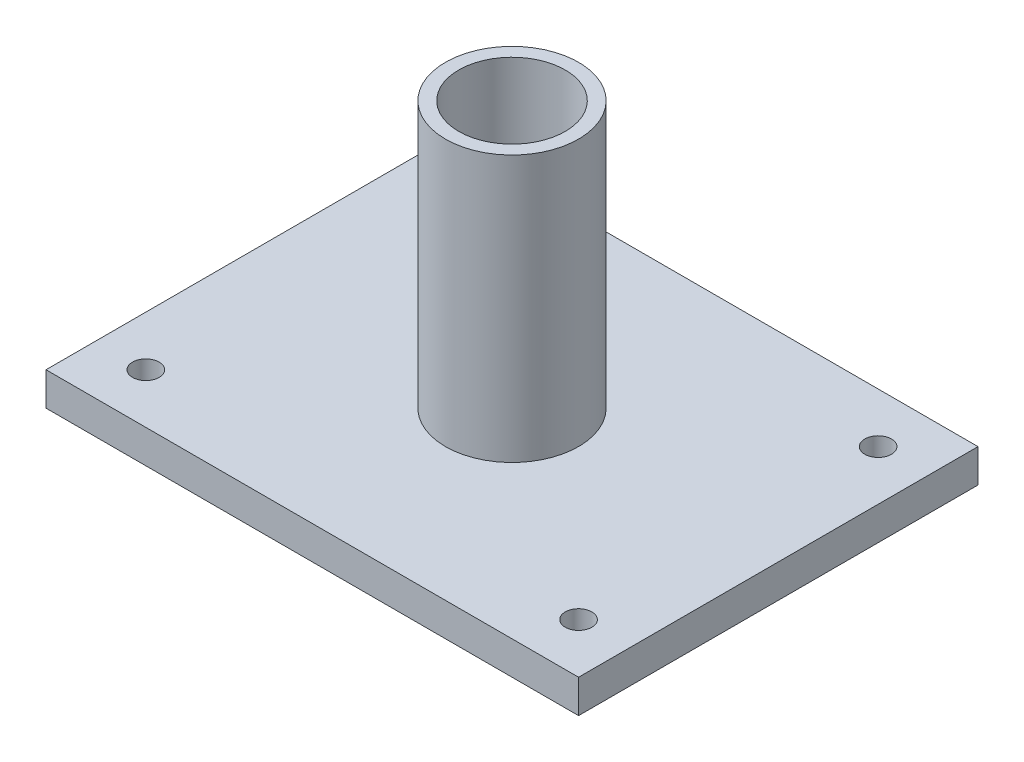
ISO-10303-21;
HEADER;
FILE_DESCRIPTION(('STEP AP214'),'2;1');
FILE_NAME('part.step','',(''),(''),'','','');
FILE_SCHEMA(('AUTOMOTIVE_DESIGN { 1 0 10303 214 1 1 1 1 }'));
ENDSEC;
DATA;
#1=APPLICATION_CONTEXT('core data for automotive mechanical design processes');
#2=APPLICATION_PROTOCOL_DEFINITION('international standard','automotive_design',2000,#1);
#3=PRODUCT_CONTEXT('',#1,'mechanical');
#4=PRODUCT('Part','Part','',(#3));
#5=PRODUCT_RELATED_PRODUCT_CATEGORY('part','',(#4));
#6=PRODUCT_DEFINITION_FORMATION('','',#4);
#7=PRODUCT_DEFINITION_CONTEXT('part definition',#1,'design');
#8=PRODUCT_DEFINITION('design','',#6,#7);
#9=PRODUCT_DEFINITION_SHAPE('','',#8);
#10=(LENGTH_UNIT() NAMED_UNIT(*) SI_UNIT(.MILLI.,.METRE.));
#11=(NAMED_UNIT(*) PLANE_ANGLE_UNIT() SI_UNIT($,.RADIAN.));
#12=(NAMED_UNIT(*) SI_UNIT($,.STERADIAN.) SOLID_ANGLE_UNIT());
#13=UNCERTAINTY_MEASURE_WITH_UNIT(LENGTH_MEASURE(1.E-05),#10,'distance_accuracy_value','');
#14=(GEOMETRIC_REPRESENTATION_CONTEXT(3) GLOBAL_UNCERTAINTY_ASSIGNED_CONTEXT((#13)) GLOBAL_UNIT_ASSIGNED_CONTEXT((#10,
#11,#12)) REPRESENTATION_CONTEXT('',''));
#15=CARTESIAN_POINT('',(0.,0.,0.));
#16=DIRECTION('',(0.,0.,1.));
#17=DIRECTION('',(1.,0.,0.));
#18=AXIS2_PLACEMENT_3D('',#15,#16,#17);
#19=CARTESIAN_POINT('',(-50.8,6.35,38.1));
#20=DIRECTION('',(1.,0.,0.));
#21=DIRECTION('',(0.,0.,-1.));
#22=AXIS2_PLACEMENT_3D('',#19,#20,#21);
#23=PLANE('',#22);
#24=DIRECTION('',(0.,0.,1.));
#25=VECTOR('',#24,1.);
#26=CARTESIAN_POINT('',(-50.8,0.,38.1));
#27=LINE('',#26,#25);
#28=CARTESIAN_POINT('',(-50.8,0.,-38.1));
#29=VERTEX_POINT('',#28);
#30=CARTESIAN_POINT('',(-50.8,0.,38.1));
#31=VERTEX_POINT('',#30);
#32=EDGE_CURVE('E97',#29,#31,#27,.T.);
#33=ORIENTED_EDGE('',*,*,#32,.T.);
#34=DIRECTION('',(0.,-1.,0.));
#35=VECTOR('',#34,1.);
#36=CARTESIAN_POINT('',(-50.8,6.35,38.1));
#37=LINE('',#36,#35);
#38=CARTESIAN_POINT('',(-50.8,6.35,38.1));
#39=VERTEX_POINT('',#38);
#40=EDGE_CURVE('E11',#39,#31,#37,.T.);
#41=ORIENTED_EDGE('',*,*,#40,.F.);
#42=DIRECTION('',(0.,0.,1.));
#43=VECTOR('',#42,1.);
#44=CARTESIAN_POINT('',(-50.8,6.35,38.1));
#45=LINE('',#44,#43);
#46=CARTESIAN_POINT('',(-50.8,6.35,-38.1));
#47=VERTEX_POINT('',#46);
#48=EDGE_CURVE('E85',#47,#39,#45,.T.);
#49=ORIENTED_EDGE('',*,*,#48,.F.);
#50=DIRECTION('',(0.,-1.,0.));
#51=VECTOR('',#50,1.);
#52=CARTESIAN_POINT('',(-50.8,6.35,-38.1));
#53=LINE('',#52,#51);
#54=EDGE_CURVE('E93',#47,#29,#53,.T.);
#55=ORIENTED_EDGE('',*,*,#54,.T.);
#56=EDGE_LOOP('',(#33,#41,#49,#55));
#57=FACE_BOUND('',#56,.T.);
#58=ADVANCED_FACE('F34',(#57),#23,.F.);
#59=CARTESIAN_POINT('',(50.8,6.35,38.1));
#60=DIRECTION('',(0.,0.,-1.));
#61=DIRECTION('',(-1.,0.,0.));
#62=AXIS2_PLACEMENT_3D('',#59,#60,#61);
#63=PLANE('',#62);
#64=DIRECTION('',(1.,0.,0.));
#65=VECTOR('',#64,1.);
#66=CARTESIAN_POINT('',(50.8,0.,38.1));
#67=LINE('',#66,#65);
#68=CARTESIAN_POINT('',(50.8,0.,38.1));
#69=VERTEX_POINT('',#68);
#70=EDGE_CURVE('E89',#31,#69,#67,.T.);
#71=ORIENTED_EDGE('',*,*,#70,.T.);
#72=DIRECTION('',(0.,-1.,0.));
#73=VECTOR('',#72,1.);
#74=CARTESIAN_POINT('',(50.8,6.35,38.1));
#75=LINE('',#74,#73);
#76=CARTESIAN_POINT('',(50.8,6.35,38.1));
#77=VERTEX_POINT('',#76);
#78=EDGE_CURVE('E42',#77,#69,#75,.T.);
#79=ORIENTED_EDGE('',*,*,#78,.F.);
#80=DIRECTION('',(1.,0.,0.));
#81=VECTOR('',#80,1.);
#82=CARTESIAN_POINT('',(50.8,6.35,38.1));
#83=LINE('',#82,#81);
#84=EDGE_CURVE('E80',#39,#77,#83,.T.);
#85=ORIENTED_EDGE('',*,*,#84,.F.);
#86=ORIENTED_EDGE('',*,*,#40,.T.);
#87=EDGE_LOOP('',(#71,#79,#85,#86));
#88=FACE_BOUND('',#87,.T.);
#89=ADVANCED_FACE('F88',(#88),#63,.F.);
#90=CARTESIAN_POINT('',(50.8,6.35,38.1));
#91=DIRECTION('',(-1.,0.,0.));
#92=DIRECTION('',(0.,0.,1.));
#93=AXIS2_PLACEMENT_3D('',#90,#91,#92);
#94=PLANE('',#93);
#95=DIRECTION('',(0.,0.,-1.));
#96=VECTOR('',#95,1.);
#97=CARTESIAN_POINT('',(50.8,0.,38.1));
#98=LINE('',#97,#96);
#99=CARTESIAN_POINT('',(50.8,0.,-38.1));
#100=VERTEX_POINT('',#99);
#101=EDGE_CURVE('E67',#69,#100,#98,.T.);
#102=ORIENTED_EDGE('',*,*,#101,.T.);
#103=DIRECTION('',(0.,-1.,0.));
#104=VECTOR('',#103,1.);
#105=CARTESIAN_POINT('',(50.8,6.35,-38.1));
#106=LINE('',#105,#104);
#107=CARTESIAN_POINT('',(50.8,6.35,-38.1));
#108=VERTEX_POINT('',#107);
#109=EDGE_CURVE('E90',#108,#100,#106,.T.);
#110=ORIENTED_EDGE('',*,*,#109,.F.);
#111=DIRECTION('',(0.,0.,-1.));
#112=VECTOR('',#111,1.);
#113=CARTESIAN_POINT('',(50.8,6.35,38.1));
#114=LINE('',#113,#112);
#115=EDGE_CURVE('E83',#77,#108,#114,.T.);
#116=ORIENTED_EDGE('',*,*,#115,.F.);
#117=ORIENTED_EDGE('',*,*,#78,.T.);
#118=EDGE_LOOP('',(#102,#110,#116,#117));
#119=FACE_BOUND('',#118,.T.);
#120=ADVANCED_FACE('F91',(#119),#94,.F.);
#121=CARTESIAN_POINT('',(50.8,6.35,-38.1));
#122=DIRECTION('',(0.,0.,1.));
#123=DIRECTION('',(1.,0.,0.));
#124=AXIS2_PLACEMENT_3D('',#121,#122,#123);
#125=PLANE('',#124);
#126=DIRECTION('',(-1.,0.,0.));
#127=VECTOR('',#126,1.);
#128=CARTESIAN_POINT('',(50.8,0.,-38.1));
#129=LINE('',#128,#127);
#130=EDGE_CURVE('E73',#100,#29,#129,.T.);
#131=ORIENTED_EDGE('',*,*,#130,.T.);
#132=ORIENTED_EDGE('',*,*,#54,.F.);
#133=DIRECTION('',(-1.,0.,0.));
#134=VECTOR('',#133,1.);
#135=CARTESIAN_POINT('',(50.8,6.35,-38.1));
#136=LINE('',#135,#134);
#137=EDGE_CURVE('E50',#108,#47,#136,.T.);
#138=ORIENTED_EDGE('',*,*,#137,.F.);
#139=ORIENTED_EDGE('',*,*,#109,.T.);
#140=EDGE_LOOP('',(#131,#132,#138,#139));
#141=FACE_BOUND('',#140,.T.);
#142=ADVANCED_FACE('F105',(#141),#125,.F.);
#143=CARTESIAN_POINT('',(-50.8,6.35,-38.1));
#144=DIRECTION('',(0.,1.,0.));
#145=DIRECTION('',(0.,0.,1.));
#146=AXIS2_PLACEMENT_3D('',#143,#144,#145);
#147=PLANE('',#146);
#148=CARTESIAN_POINT('',(-41.275,6.35,28.575));
#149=DIRECTION('',(0.,1.,0.));
#150=DIRECTION('',(0.,0.,1.));
#151=AXIS2_PLACEMENT_3D('',#148,#149,#150);
#152=CIRCLE('',#151,2.54);
#153=CARTESIAN_POINT('',(-41.275,6.35,31.115));
#154=VERTEX_POINT('',#153);
#155=EDGE_CURVE('E133',#154,#154,#152,.T.);
#156=ORIENTED_EDGE('',*,*,#155,.F.);
#157=EDGE_LOOP('',(#156));
#158=FACE_BOUND('',#157,.T.);
#159=CARTESIAN_POINT('',(41.275,6.35,28.575));
#160=DIRECTION('',(0.,1.,0.));
#161=DIRECTION('',(0.,0.,1.));
#162=AXIS2_PLACEMENT_3D('',#159,#160,#161);
#163=CIRCLE('',#162,2.54);
#164=CARTESIAN_POINT('',(41.275,6.35,31.115));
#165=VERTEX_POINT('',#164);
#166=EDGE_CURVE('E127',#165,#165,#163,.T.);
#167=ORIENTED_EDGE('',*,*,#166,.F.);
#168=EDGE_LOOP('',(#167));
#169=FACE_BOUND('',#168,.T.);
#170=CARTESIAN_POINT('',(41.275,6.35,-28.575));
#171=DIRECTION('',(0.,1.,0.));
#172=DIRECTION('',(0.,0.,1.));
#173=AXIS2_PLACEMENT_3D('',#170,#171,#172);
#174=CIRCLE('',#173,2.54);
#175=CARTESIAN_POINT('',(41.275,6.35,-26.035));
#176=VERTEX_POINT('',#175);
#177=EDGE_CURVE('E121',#176,#176,#174,.T.);
#178=ORIENTED_EDGE('',*,*,#177,.F.);
#179=EDGE_LOOP('',(#178));
#180=FACE_BOUND('',#179,.T.);
#181=CARTESIAN_POINT('',(-41.275,6.35,-28.575));
#182=DIRECTION('',(0.,1.,0.));
#183=DIRECTION('',(0.,0.,1.));
#184=AXIS2_PLACEMENT_3D('',#181,#182,#183);
#185=CIRCLE('',#184,2.54);
#186=CARTESIAN_POINT('',(-41.275,6.35,-26.035));
#187=VERTEX_POINT('',#186);
#188=EDGE_CURVE('E115',#187,#187,#185,.T.);
#189=ORIENTED_EDGE('',*,*,#188,.F.);
#190=EDGE_LOOP('',(#189));
#191=FACE_BOUND('',#190,.T.);
#192=CARTESIAN_POINT('',(0.,6.35,0.));
#193=DIRECTION('',(0.,1.,0.));
#194=DIRECTION('',(0.,0.,1.));
#195=AXIS2_PLACEMENT_3D('',#192,#193,#194);
#196=CIRCLE('',#195,12.7);
#197=CARTESIAN_POINT('',(0.,6.35,12.7));
#198=VERTEX_POINT('',#197);
#199=EDGE_CURVE('E100',#198,#198,#196,.T.);
#200=ORIENTED_EDGE('',*,*,#199,.F.);
#201=EDGE_LOOP('',(#200));
#202=FACE_BOUND('',#201,.T.);
#203=ORIENTED_EDGE('',*,*,#48,.T.);
#204=ORIENTED_EDGE('',*,*,#84,.T.);
#205=ORIENTED_EDGE('',*,*,#115,.T.);
#206=ORIENTED_EDGE('',*,*,#137,.T.);
#207=EDGE_LOOP('',(#203,#204,#205,#206));
#208=FACE_BOUND('',#207,.T.);
#209=ADVANCED_FACE('F81',(#158,#169,#180,#191,#202,#208),#147,.T.);
#210=CARTESIAN_POINT('',(-50.8,0.,-38.1));
#211=DIRECTION('',(0.,1.,0.));
#212=DIRECTION('',(0.,0.,1.));
#213=AXIS2_PLACEMENT_3D('',#210,#211,#212);
#214=PLANE('',#213);
#215=CARTESIAN_POINT('',(-41.275,0.,28.575));
#216=DIRECTION('',(0.,1.,0.));
#217=DIRECTION('',(0.,0.,1.));
#218=AXIS2_PLACEMENT_3D('',#215,#216,#217);
#219=CIRCLE('',#218,2.54);
#220=CARTESIAN_POINT('',(-41.275,0.,31.115));
#221=VERTEX_POINT('',#220);
#222=EDGE_CURVE('E130',#221,#221,#219,.T.);
#223=ORIENTED_EDGE('',*,*,#222,.T.);
#224=EDGE_LOOP('',(#223));
#225=FACE_BOUND('',#224,.T.);
#226=CARTESIAN_POINT('',(41.275,0.,28.575));
#227=DIRECTION('',(0.,1.,0.));
#228=DIRECTION('',(0.,0.,1.));
#229=AXIS2_PLACEMENT_3D('',#226,#227,#228);
#230=CIRCLE('',#229,2.54);
#231=CARTESIAN_POINT('',(41.275,0.,31.115));
#232=VERTEX_POINT('',#231);
#233=EDGE_CURVE('E124',#232,#232,#230,.T.);
#234=ORIENTED_EDGE('',*,*,#233,.T.);
#235=EDGE_LOOP('',(#234));
#236=FACE_BOUND('',#235,.T.);
#237=CARTESIAN_POINT('',(41.275,0.,-28.575));
#238=DIRECTION('',(0.,1.,0.));
#239=DIRECTION('',(0.,0.,1.));
#240=AXIS2_PLACEMENT_3D('',#237,#238,#239);
#241=CIRCLE('',#240,2.54);
#242=CARTESIAN_POINT('',(41.275,0.,-26.035));
#243=VERTEX_POINT('',#242);
#244=EDGE_CURVE('E118',#243,#243,#241,.T.);
#245=ORIENTED_EDGE('',*,*,#244,.T.);
#246=EDGE_LOOP('',(#245));
#247=FACE_BOUND('',#246,.T.);
#248=CARTESIAN_POINT('',(-41.275,0.,-28.575));
#249=DIRECTION('',(0.,1.,0.));
#250=DIRECTION('',(0.,0.,1.));
#251=AXIS2_PLACEMENT_3D('',#248,#249,#250);
#252=CIRCLE('',#251,2.54);
#253=CARTESIAN_POINT('',(-41.275,0.,-26.035));
#254=VERTEX_POINT('',#253);
#255=EDGE_CURVE('E114',#254,#254,#252,.T.);
#256=ORIENTED_EDGE('',*,*,#255,.T.);
#257=EDGE_LOOP('',(#256));
#258=FACE_BOUND('',#257,.T.);
#259=ORIENTED_EDGE('',*,*,#32,.F.);
#260=ORIENTED_EDGE('',*,*,#130,.F.);
#261=ORIENTED_EDGE('',*,*,#101,.F.);
#262=ORIENTED_EDGE('',*,*,#70,.F.);
#263=EDGE_LOOP('',(#259,#260,#261,#262));
#264=FACE_BOUND('',#263,.T.);
#265=CARTESIAN_POINT('',(0.,0.,0.));
#266=DIRECTION('',(0.,1.,0.));
#267=DIRECTION('',(0.,0.,1.));
#268=AXIS2_PLACEMENT_3D('',#265,#266,#267);
#269=CIRCLE('',#268,10.16);
#270=CARTESIAN_POINT('',(0.,0.,10.16));
#271=VERTEX_POINT('',#270);
#272=EDGE_CURVE('E136',#271,#271,#269,.F.);
#273=ORIENTED_EDGE('',*,*,#272,.F.);
#274=EDGE_LOOP('',(#273));
#275=FACE_BOUND('',#274,.T.);
#276=ADVANCED_FACE('F108',(#225,#236,#247,#258,#264,#275),#214,.F.);
#277=CARTESIAN_POINT('',(-41.275,0.,-28.575));
#278=DIRECTION('',(0.,1.,0.));
#279=DIRECTION('',(0.,0.,1.));
#280=AXIS2_PLACEMENT_3D('',#277,#278,#279);
#281=CYLINDRICAL_SURFACE('',#280,2.54);
#282=ORIENTED_EDGE('',*,*,#255,.F.);
#283=EDGE_LOOP('',(#282));
#284=FACE_BOUND('',#283,.T.);
#285=ORIENTED_EDGE('',*,*,#188,.T.);
#286=EDGE_LOOP('',(#285));
#287=FACE_BOUND('',#286,.T.);
#288=ADVANCED_FACE('F179',(#284,#287),#281,.F.);
#289=CARTESIAN_POINT('',(41.275,0.,-28.575));
#290=DIRECTION('',(0.,1.,0.));
#291=DIRECTION('',(0.,0.,1.));
#292=AXIS2_PLACEMENT_3D('',#289,#290,#291);
#293=CYLINDRICAL_SURFACE('',#292,2.54);
#294=ORIENTED_EDGE('',*,*,#244,.F.);
#295=EDGE_LOOP('',(#294));
#296=FACE_BOUND('',#295,.T.);
#297=ORIENTED_EDGE('',*,*,#177,.T.);
#298=EDGE_LOOP('',(#297));
#299=FACE_BOUND('',#298,.T.);
#300=ADVANCED_FACE('F186',(#296,#299),#293,.F.);
#301=CARTESIAN_POINT('',(41.275,0.,28.575));
#302=DIRECTION('',(0.,1.,0.));
#303=DIRECTION('',(0.,0.,1.));
#304=AXIS2_PLACEMENT_3D('',#301,#302,#303);
#305=CYLINDRICAL_SURFACE('',#304,2.54);
#306=ORIENTED_EDGE('',*,*,#233,.F.);
#307=EDGE_LOOP('',(#306));
#308=FACE_BOUND('',#307,.T.);
#309=ORIENTED_EDGE('',*,*,#166,.T.);
#310=EDGE_LOOP('',(#309));
#311=FACE_BOUND('',#310,.T.);
#312=ADVANCED_FACE('F190',(#308,#311),#305,.F.);
#313=CARTESIAN_POINT('',(-41.275,0.,28.575));
#314=DIRECTION('',(0.,1.,0.));
#315=DIRECTION('',(0.,0.,1.));
#316=AXIS2_PLACEMENT_3D('',#313,#314,#315);
#317=CYLINDRICAL_SURFACE('',#316,2.54);
#318=ORIENTED_EDGE('',*,*,#222,.F.);
#319=EDGE_LOOP('',(#318));
#320=FACE_BOUND('',#319,.T.);
#321=ORIENTED_EDGE('',*,*,#155,.T.);
#322=EDGE_LOOP('',(#321));
#323=FACE_BOUND('',#322,.T.);
#324=ADVANCED_FACE('F163',(#320,#323),#317,.F.);
#325=CARTESIAN_POINT('',(0.,-35.9210244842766,0.));
#326=DIRECTION('',(0.,1.,0.));
#327=DIRECTION('',(0.,0.,1.));
#328=AXIS2_PLACEMENT_3D('',#325,#326,#327);
#329=CYLINDRICAL_SURFACE('',#328,10.16);
#330=CARTESIAN_POINT('',(0.,57.15,0.));
#331=DIRECTION('',(0.,1.,0.));
#332=DIRECTION('',(0.,0.,1.));
#333=AXIS2_PLACEMENT_3D('',#330,#331,#332);
#334=CIRCLE('',#333,10.16);
#335=CARTESIAN_POINT('',(0.,57.15,10.16));
#336=VERTEX_POINT('',#335);
#337=EDGE_CURVE('E144',#336,#336,#334,.T.);
#338=CARTESIAN_POINT('',(0.,0.,10.16));
#339=CARTESIAN_POINT('',(0.,0.595312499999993,10.16));
#340=CARTESIAN_POINT('',(0.,1.19062499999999,10.16));
#341=CARTESIAN_POINT('',(0.,2.38124999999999,10.16));
#342=CARTESIAN_POINT('',(0.,2.97656249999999,10.16));
#343=CARTESIAN_POINT('',(0.,4.1671875,10.16));
#344=CARTESIAN_POINT('',(0.,4.7625,10.16));
#345=CARTESIAN_POINT('',(0.,5.953125,10.16));
#346=CARTESIAN_POINT('',(0.,6.5484375,10.16));
#347=CARTESIAN_POINT('',(0.,7.7390625,10.16));
#348=CARTESIAN_POINT('',(0.,8.334375,10.16));
#349=CARTESIAN_POINT('',(0.,9.525,10.16));
#350=CARTESIAN_POINT('',(0.,10.1203125,10.16));
#351=CARTESIAN_POINT('',(0.,11.3109375,10.16));
#352=CARTESIAN_POINT('',(0.,11.90625,10.16));
#353=CARTESIAN_POINT('',(0.,13.096875,10.16));
#354=CARTESIAN_POINT('',(0.,13.6921875,10.16));
#355=CARTESIAN_POINT('',(0.,14.8828125,10.16));
#356=CARTESIAN_POINT('',(0.,15.478125,10.16));
#357=CARTESIAN_POINT('',(0.,16.66875,10.16));
#358=CARTESIAN_POINT('',(0.,17.2640625,10.16));
#359=CARTESIAN_POINT('',(0.,18.4546875,10.16));
#360=CARTESIAN_POINT('',(0.,19.05,10.16));
#361=CARTESIAN_POINT('',(0.,20.240625,10.16));
#362=CARTESIAN_POINT('',(0.,20.8359375,10.16));
#363=CARTESIAN_POINT('',(0.,22.0265625,10.16));
#364=CARTESIAN_POINT('',(0.,22.621875,10.16));
#365=CARTESIAN_POINT('',(0.,23.8125,10.16));
#366=CARTESIAN_POINT('',(0.,24.4078125,10.16));
#367=CARTESIAN_POINT('',(0.,25.5984375,10.16));
#368=CARTESIAN_POINT('',(0.,26.19375,10.16));
#369=CARTESIAN_POINT('',(0.,27.384375,10.16));
#370=CARTESIAN_POINT('',(0.,27.9796875,10.16));
#371=CARTESIAN_POINT('',(0.,29.1703125,10.16));
#372=CARTESIAN_POINT('',(0.,29.765625,10.16));
#373=CARTESIAN_POINT('',(0.,30.95625,10.16));
#374=CARTESIAN_POINT('',(0.,31.5515625,10.16));
#375=CARTESIAN_POINT('',(0.,32.7421875,10.16));
#376=CARTESIAN_POINT('',(0.,33.3375,10.16));
#377=CARTESIAN_POINT('',(0.,34.528125,10.16));
#378=CARTESIAN_POINT('',(0.,35.1234375,10.16));
#379=CARTESIAN_POINT('',(0.,36.3140625,10.16));
#380=CARTESIAN_POINT('',(0.,36.909375,10.16));
#381=CARTESIAN_POINT('',(0.,38.1,10.16));
#382=CARTESIAN_POINT('',(0.,38.6953125,10.16));
#383=CARTESIAN_POINT('',(0.,39.8859375,10.16));
#384=CARTESIAN_POINT('',(0.,40.48125,10.16));
#385=CARTESIAN_POINT('',(0.,41.671875,10.16));
#386=CARTESIAN_POINT('',(0.,42.2671875,10.16));
#387=CARTESIAN_POINT('',(0.,43.4578125,10.16));
#388=CARTESIAN_POINT('',(0.,44.053125,10.16));
#389=CARTESIAN_POINT('',(0.,45.24375,10.16));
#390=CARTESIAN_POINT('',(0.,45.8390625,10.16));
#391=CARTESIAN_POINT('',(0.,47.0296875,10.16));
#392=CARTESIAN_POINT('',(0.,47.625,10.16));
#393=CARTESIAN_POINT('',(0.,48.815625,10.16));
#394=CARTESIAN_POINT('',(0.,49.4109375,10.16));
#395=CARTESIAN_POINT('',(0.,50.6015625,10.16));
#396=CARTESIAN_POINT('',(0.,51.196875,10.16));
#397=CARTESIAN_POINT('',(0.,52.3875,10.16));
#398=CARTESIAN_POINT('',(0.,52.9828125,10.16));
#399=CARTESIAN_POINT('',(0.,54.1734375,10.16));
#400=CARTESIAN_POINT('',(0.,54.76875,10.16));
#401=CARTESIAN_POINT('',(0.,55.959375,10.16));
#402=CARTESIAN_POINT('',(0.,56.5546875,10.16));
#403=CARTESIAN_POINT('',(0.,57.15,10.16));
#404=B_SPLINE_CURVE_WITH_KNOTS('',3,(#338,#339,#340,#341,#342,#343,#344,#345,#346,#347,#348,
#349,#350,#351,#352,#353,#354,#355,#356,#357,#358,#359,#360,#361,#362,#363,#364,#365,#366,#367,
#368,#369,#370,#371,#372,#373,#374,#375,#376,#377,#378,#379,#380,#381,#382,#383,#384,#385,#386,
#387,#388,#389,#390,#391,#392,#393,#394,#395,#396,#397,#398,#399,#400,#401,#402,#403),
.UNSPECIFIED.,.F.,.F.,(4,2,2,2,2,2,2,2,2,2,2,2,2,2,2,2,2,2,2,2,2,2,2,2,2,2,2,2,2,2,2,2,4),(0.,
1.7859375,3.571875,5.3578125,7.14375,8.92968750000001,10.715625,12.5015625,14.2875,16.0734375,
17.859375,19.6453125,21.43125,23.2171875,25.003125,26.7890625,28.575,30.3609375,32.146875,
33.9328125,35.71875,37.5046875,39.290625,41.0765625,42.8625,44.6484375,46.434375,48.2203125,
50.00625,51.7921875,53.578125,55.3640625,57.15),.UNSPECIFIED.);
#405=EDGE_CURVE('BSEAM148',#271,#336,#404,.T.);
#406=ORIENTED_EDGE('',*,*,#272,.T.);
#407=ORIENTED_EDGE('',*,*,#337,.T.);
#408=ORIENTED_EDGE('',*,*,#405,.T.);
#409=ORIENTED_EDGE('',*,*,#405,.F.);
#410=EDGE_LOOP('',(#406,#408,#407,#409));
#411=FACE_BOUND('',#410,.T.);
#412=ADVANCED_FACE('F148',(#411),#329,.F.);
#413=CARTESIAN_POINT('',(0.,-35.9210244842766,0.));
#414=DIRECTION('',(0.,1.,0.));
#415=DIRECTION('',(0.,0.,1.));
#416=AXIS2_PLACEMENT_3D('',#413,#414,#415);
#417=CYLINDRICAL_SURFACE('',#416,12.7);
#418=CARTESIAN_POINT('',(0.,57.15,0.));
#419=DIRECTION('',(0.,1.,0.));
#420=DIRECTION('',(0.,0.,1.));
#421=AXIS2_PLACEMENT_3D('',#418,#419,#420);
#422=CIRCLE('',#421,12.7);
#423=CARTESIAN_POINT('',(0.,57.15,12.7));
#424=VERTEX_POINT('',#423);
#425=EDGE_CURVE('E141',#424,#424,#422,.F.);
#426=CARTESIAN_POINT('',(0.,6.35,12.7));
#427=CARTESIAN_POINT('',(0.,6.87916666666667,12.7));
#428=CARTESIAN_POINT('',(0.,7.40833333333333,12.7));
#429=CARTESIAN_POINT('',(0.,8.46666666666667,12.7));
#430=CARTESIAN_POINT('',(0.,8.99583333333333,12.7));
#431=CARTESIAN_POINT('',(0.,10.0541666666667,12.7));
#432=CARTESIAN_POINT('',(0.,10.5833333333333,12.7));
#433=CARTESIAN_POINT('',(0.,11.6416666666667,12.7));
#434=CARTESIAN_POINT('',(0.,12.1708333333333,12.7));
#435=CARTESIAN_POINT('',(0.,13.2291666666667,12.7));
#436=CARTESIAN_POINT('',(0.,13.7583333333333,12.7));
#437=CARTESIAN_POINT('',(0.,14.8166666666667,12.7));
#438=CARTESIAN_POINT('',(0.,15.3458333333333,12.7));
#439=CARTESIAN_POINT('',(0.,16.4041666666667,12.7));
#440=CARTESIAN_POINT('',(0.,16.9333333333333,12.7));
#441=CARTESIAN_POINT('',(0.,17.9916666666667,12.7));
#442=CARTESIAN_POINT('',(0.,18.5208333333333,12.7));
#443=CARTESIAN_POINT('',(0.,19.5791666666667,12.7));
#444=CARTESIAN_POINT('',(0.,20.1083333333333,12.7));
#445=CARTESIAN_POINT('',(0.,21.1666666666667,12.7));
#446=CARTESIAN_POINT('',(0.,21.6958333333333,12.7));
#447=CARTESIAN_POINT('',(0.,22.7541666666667,12.7));
#448=CARTESIAN_POINT('',(0.,23.2833333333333,12.7));
#449=CARTESIAN_POINT('',(0.,24.3416666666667,12.7));
#450=CARTESIAN_POINT('',(0.,24.8708333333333,12.7));
#451=CARTESIAN_POINT('',(0.,25.9291666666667,12.7));
#452=CARTESIAN_POINT('',(0.,26.4583333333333,12.7));
#453=CARTESIAN_POINT('',(0.,27.5166666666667,12.7));
#454=CARTESIAN_POINT('',(0.,28.0458333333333,12.7));
#455=CARTESIAN_POINT('',(0.,29.1041666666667,12.7));
#456=CARTESIAN_POINT('',(0.,29.6333333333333,12.7));
#457=CARTESIAN_POINT('',(0.,30.6916666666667,12.7));
#458=CARTESIAN_POINT('',(0.,31.2208333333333,12.7));
#459=CARTESIAN_POINT('',(0.,32.2791666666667,12.7));
#460=CARTESIAN_POINT('',(0.,32.8083333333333,12.7));
#461=CARTESIAN_POINT('',(0.,33.8666666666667,12.7));
#462=CARTESIAN_POINT('',(0.,34.3958333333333,12.7));
#463=CARTESIAN_POINT('',(0.,35.4541666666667,12.7));
#464=CARTESIAN_POINT('',(0.,35.9833333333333,12.7));
#465=CARTESIAN_POINT('',(0.,37.0416666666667,12.7));
#466=CARTESIAN_POINT('',(0.,37.5708333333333,12.7));
#467=CARTESIAN_POINT('',(0.,38.6291666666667,12.7));
#468=CARTESIAN_POINT('',(0.,39.1583333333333,12.7));
#469=CARTESIAN_POINT('',(0.,40.2166666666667,12.7));
#470=CARTESIAN_POINT('',(0.,40.7458333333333,12.7));
#471=CARTESIAN_POINT('',(0.,41.8041666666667,12.7));
#472=CARTESIAN_POINT('',(0.,42.3333333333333,12.7));
#473=CARTESIAN_POINT('',(0.,43.3916666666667,12.7));
#474=CARTESIAN_POINT('',(0.,43.9208333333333,12.7));
#475=CARTESIAN_POINT('',(0.,44.9791666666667,12.7));
#476=CARTESIAN_POINT('',(0.,45.5083333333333,12.7));
#477=CARTESIAN_POINT('',(0.,46.5666666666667,12.7));
#478=CARTESIAN_POINT('',(0.,47.0958333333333,12.7));
#479=CARTESIAN_POINT('',(0.,48.1541666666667,12.7));
#480=CARTESIAN_POINT('',(0.,48.6833333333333,12.7));
#481=CARTESIAN_POINT('',(0.,49.7416666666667,12.7));
#482=CARTESIAN_POINT('',(0.,50.2708333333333,12.7));
#483=CARTESIAN_POINT('',(0.,51.3291666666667,12.7));
#484=CARTESIAN_POINT('',(0.,51.8583333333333,12.7));
#485=CARTESIAN_POINT('',(0.,52.9166666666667,12.7));
#486=CARTESIAN_POINT('',(0.,53.4458333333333,12.7));
#487=CARTESIAN_POINT('',(0.,54.5041666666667,12.7));
#488=CARTESIAN_POINT('',(0.,55.0333333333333,12.7));
#489=CARTESIAN_POINT('',(0.,56.0916666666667,12.7));
#490=CARTESIAN_POINT('',(0.,56.6208333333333,12.7));
#491=CARTESIAN_POINT('',(0.,57.15,12.7));
#492=B_SPLINE_CURVE_WITH_KNOTS('',3,(#426,#427,#428,#429,#430,#431,#432,#433,#434,#435,#436,
#437,#438,#439,#440,#441,#442,#443,#444,#445,#446,#447,#448,#449,#450,#451,#452,#453,#454,#455,
#456,#457,#458,#459,#460,#461,#462,#463,#464,#465,#466,#467,#468,#469,#470,#471,#472,#473,#474,
#475,#476,#477,#478,#479,#480,#481,#482,#483,#484,#485,#486,#487,#488,#489,#490,#491),
.UNSPECIFIED.,.F.,.F.,(4,2,2,2,2,2,2,2,2,2,2,2,2,2,2,2,2,2,2,2,2,2,2,2,2,2,2,2,2,2,2,2,4),(0.,
1.5875,3.175,4.7625,6.35,7.9375,9.525,11.1125,12.7,14.2875,15.875,17.4625,19.05,20.6375,22.225,
23.8125,25.4,26.9875,28.575,30.1625,31.75,33.3375,34.925,36.5125,38.1,39.6875,41.275,42.8625,
44.45,46.0375,47.625,49.2125,50.8),.UNSPECIFIED.);
#493=EDGE_CURVE('BSEAM153',#198,#424,#492,.T.);
#494=ORIENTED_EDGE('',*,*,#199,.T.);
#495=ORIENTED_EDGE('',*,*,#425,.T.);
#496=ORIENTED_EDGE('',*,*,#493,.T.);
#497=ORIENTED_EDGE('',*,*,#493,.F.);
#498=EDGE_LOOP('',(#494,#496,#495,#497));
#499=FACE_BOUND('',#498,.T.);
#500=ADVANCED_FACE('F153',(#499),#417,.T.);
#501=CARTESIAN_POINT('',(-98.924238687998,57.15,0.));
#502=DIRECTION('',(0.,1.,0.));
#503=DIRECTION('',(0.,0.,1.));
#504=AXIS2_PLACEMENT_3D('',#501,#502,#503);
#505=PLANE('',#504);
#506=ORIENTED_EDGE('',*,*,#337,.F.);
#507=EDGE_LOOP('',(#506));
#508=FACE_BOUND('',#507,.T.);
#509=ORIENTED_EDGE('',*,*,#425,.F.);
#510=EDGE_LOOP('',(#509));
#511=FACE_BOUND('',#510,.T.);
#512=ADVANCED_FACE('F150',(#508,#511),#505,.T.);
#513=CLOSED_SHELL('',(#58,#89,#120,#142,#209,#276,#288,#300,#312,#324,#412,#500,#512));
#514=MANIFOLD_SOLID_BREP('B2',#513);
#515=ADVANCED_BREP_SHAPE_REPRESENTATION('',(#18,#514),#14);
#516=SHAPE_DEFINITION_REPRESENTATION(#9,#515);
ENDSEC;
END-ISO-10303-21;
